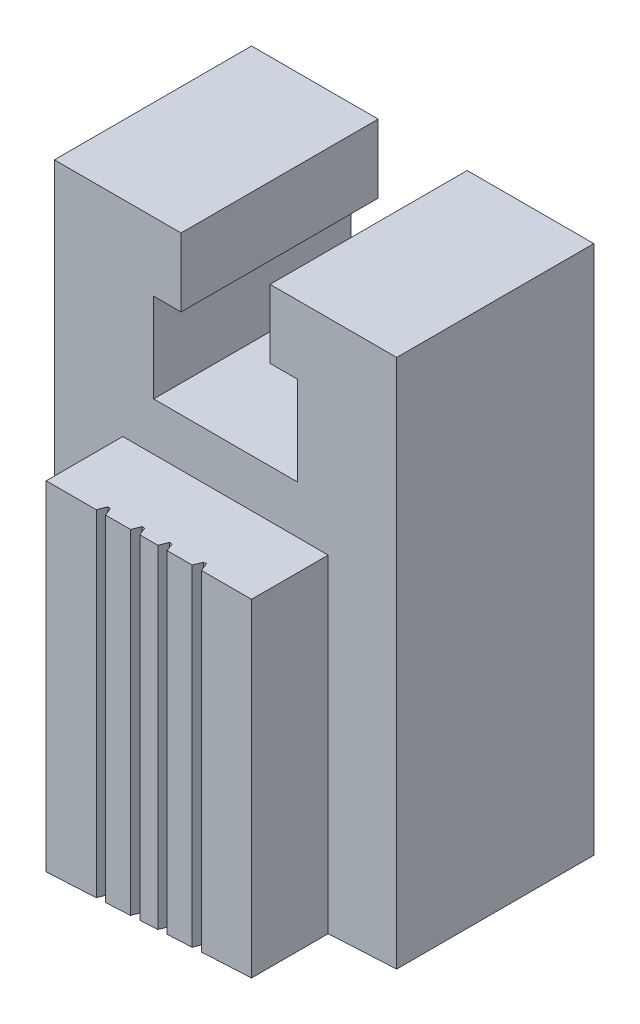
ISO-10303-21;
HEADER;
FILE_DESCRIPTION(('STEP AP214'),'2;1');
FILE_NAME('part.step','',(''),(''),'','','');
FILE_SCHEMA(('AUTOMOTIVE_DESIGN { 1 0 10303 214 1 1 1 1 }'));
ENDSEC;
DATA;
#1=APPLICATION_CONTEXT('core data for automotive mechanical design processes');
#2=APPLICATION_PROTOCOL_DEFINITION('international standard','automotive_design',2000,#1);
#3=PRODUCT_CONTEXT('',#1,'mechanical');
#4=PRODUCT('Part','Part','',(#3));
#5=PRODUCT_RELATED_PRODUCT_CATEGORY('part','',(#4));
#6=PRODUCT_DEFINITION_FORMATION('','',#4);
#7=PRODUCT_DEFINITION_CONTEXT('part definition',#1,'design');
#8=PRODUCT_DEFINITION('design','',#6,#7);
#9=PRODUCT_DEFINITION_SHAPE('','',#8);
#10=(LENGTH_UNIT() NAMED_UNIT(*) SI_UNIT(.MILLI.,.METRE.));
#11=(NAMED_UNIT(*) PLANE_ANGLE_UNIT() SI_UNIT($,.RADIAN.));
#12=(NAMED_UNIT(*) SI_UNIT($,.STERADIAN.) SOLID_ANGLE_UNIT());
#13=UNCERTAINTY_MEASURE_WITH_UNIT(LENGTH_MEASURE(1.E-05),#10,'distance_accuracy_value','');
#14=(GEOMETRIC_REPRESENTATION_CONTEXT(3) GLOBAL_UNCERTAINTY_ASSIGNED_CONTEXT((#13)) GLOBAL_UNIT_ASSIGNED_CONTEXT((#10,
#11,#12)) REPRESENTATION_CONTEXT('',''));
#15=CARTESIAN_POINT('',(0.,0.,0.));
#16=DIRECTION('',(0.,0.,1.));
#17=DIRECTION('',(1.,0.,0.));
#18=AXIS2_PLACEMENT_3D('',#15,#16,#17);
#19=CARTESIAN_POINT('',(0.,1.13686837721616E-13,20.));
#20=DIRECTION('',(1.,0.,0.));
#21=DIRECTION('',(0.,0.,-1.));
#22=AXIS2_PLACEMENT_3D('',#19,#20,#21);
#23=PLANE('',#22);
#24=DIRECTION('',(0.,0.,-1.));
#25=VECTOR('',#24,1.);
#26=CARTESIAN_POINT('',(0.,1.13686837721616E-13,20.));
#27=LINE('',#26,#25);
#28=CARTESIAN_POINT('',(0.,1.11022302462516E-13,14.4000000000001));
#29=VERTEX_POINT('',#28);
#30=CARTESIAN_POINT('',(0.,1.13686837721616E-13,0.));
#31=VERTEX_POINT('',#30);
#32=EDGE_CURVE('E260',#29,#31,#27,.T.);
#33=ORIENTED_EDGE('',*,*,#32,.F.);
#34=DIRECTION('',(0.,-1.,0.));
#35=VECTOR('',#34,1.);
#36=CARTESIAN_POINT('',(0.,25.,14.3999999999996));
#37=LINE('',#36,#35);
#38=CARTESIAN_POINT('',(0.,40.,14.3999999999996));
#39=VERTEX_POINT('',#38);
#40=EDGE_CURVE('E241',#39,#29,#37,.T.);
#41=ORIENTED_EDGE('',*,*,#40,.F.);
#42=DIRECTION('',(0.,0.,-1.));
#43=VECTOR('',#42,1.);
#44=CARTESIAN_POINT('',(0.,40.0000000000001,20.));
#45=LINE('',#44,#43);
#46=CARTESIAN_POINT('',(0.,40.0000000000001,0.));
#47=VERTEX_POINT('',#46);
#48=EDGE_CURVE('E460',#39,#47,#45,.T.);
#49=ORIENTED_EDGE('',*,*,#48,.T.);
#50=DIRECTION('',(0.,-1.,0.));
#51=VECTOR('',#50,1.);
#52=CARTESIAN_POINT('',(0.,1.13686837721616E-13,0.));
#53=LINE('',#52,#51);
#54=EDGE_CURVE('E268',#47,#31,#53,.T.);
#55=ORIENTED_EDGE('',*,*,#54,.T.);
#56=EDGE_LOOP('',(#33,#41,#49,#55));
#57=FACE_BOUND('',#56,.T.);
#58=ADVANCED_FACE('F34',(#57),#23,.F.);
#59=CARTESIAN_POINT('',(25.,1.31019448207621,20.));
#60=DIRECTION('',(-1.,0.,0.));
#61=DIRECTION('',(0.,0.,1.));
#62=AXIS2_PLACEMENT_3D('',#59,#60,#61);
#63=PLANE('',#62);
#64=DIRECTION('',(0.,-1.,0.));
#65=VECTOR('',#64,1.);
#66=CARTESIAN_POINT('',(25.,25.,14.3999999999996));
#67=LINE('',#66,#65);
#68=CARTESIAN_POINT('',(25.,40.,14.3999999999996));
#69=VERTEX_POINT('',#68);
#70=CARTESIAN_POINT('',(25.,1.31019448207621,14.4000000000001));
#71=VERTEX_POINT('',#70);
#72=EDGE_CURVE('E253',#69,#71,#67,.T.);
#73=ORIENTED_EDGE('',*,*,#72,.T.);
#74=DIRECTION('',(0.,0.,-1.));
#75=VECTOR('',#74,1.);
#76=CARTESIAN_POINT('',(25.,1.31019448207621,20.));
#77=LINE('',#76,#75);
#78=CARTESIAN_POINT('',(25.,1.31019448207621,0.));
#79=VERTEX_POINT('',#78);
#80=EDGE_CURVE('E270',#71,#79,#77,.T.);
#81=ORIENTED_EDGE('',*,*,#80,.T.);
#82=DIRECTION('',(0.,1.,0.));
#83=VECTOR('',#82,1.);
#84=CARTESIAN_POINT('',(25.,1.31019448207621,0.));
#85=LINE('',#84,#83);
#86=CARTESIAN_POINT('',(25.,40.0000000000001,0.));
#87=VERTEX_POINT('',#86);
#88=EDGE_CURVE('E424',#79,#87,#85,.T.);
#89=ORIENTED_EDGE('',*,*,#88,.T.);
#90=DIRECTION('',(0.,0.,-1.));
#91=VECTOR('',#90,1.);
#92=CARTESIAN_POINT('',(25.,40.0000000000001,20.));
#93=LINE('',#92,#91);
#94=EDGE_CURVE('E275',#69,#87,#93,.T.);
#95=ORIENTED_EDGE('',*,*,#94,.F.);
#96=EDGE_LOOP('',(#73,#81,#89,#95));
#97=FACE_BOUND('',#96,.T.);
#98=ADVANCED_FACE('F416',(#97),#63,.F.);
#99=CARTESIAN_POINT('',(0.,40.0000000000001,20.));
#100=DIRECTION('',(0.,0.,-1.));
#101=DIRECTION('',(-1.,0.,0.));
#102=AXIS2_PLACEMENT_3D('',#99,#100,#101);
#103=PLANE('',#102);
#104=DIRECTION('',(0.,1.,0.));
#105=VECTOR('',#104,1.);
#106=CARTESIAN_POINT('',(20.,1.11022302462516E-13,19.9999999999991));
#107=LINE('',#106,#105);
#108=CARTESIAN_POINT('',(20.,1.04815558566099,19.9999999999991));
#109=VERTEX_POINT('',#108);
#110=CARTESIAN_POINT('',(20.,25.,19.9999999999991));
#111=VERTEX_POINT('',#110);
#112=EDGE_CURVE('E326',#109,#111,#107,.T.);
#113=ORIENTED_EDGE('',*,*,#112,.T.);
#114=DIRECTION('',(1.,0.,0.));
#115=VECTOR('',#114,1.);
#116=CARTESIAN_POINT('',(0.,25.,20.));
#117=LINE('',#116,#115);
#118=CARTESIAN_POINT('',(16.3400000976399,25.,19.9999999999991));
#119=VERTEX_POINT('',#118);
#120=EDGE_CURVE('E315',#119,#111,#117,.T.);
#121=ORIENTED_EDGE('',*,*,#120,.F.);
#122=DIRECTION('',(0.,1.,0.));
#123=VECTOR('',#122,1.);
#124=CARTESIAN_POINT('',(16.3400000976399,1.11022302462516E-13,19.9999999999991));
#125=LINE('',#124,#123);
#126=CARTESIAN_POINT('',(16.3400000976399,0.85634311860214,19.9999999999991));
#127=VERTEX_POINT('',#126);
#128=EDGE_CURVE('E324',#127,#119,#125,.T.);
#129=ORIENTED_EDGE('',*,*,#128,.F.);
#130=DIRECTION('',(0.998629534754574,0.0523359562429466,0.));
#131=VECTOR('',#130,1.);
#132=CARTESIAN_POINT('',(0.,1.13686837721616E-13,20.));
#133=LINE('',#132,#131);
#134=EDGE_CURVE('E459',#127,#109,#133,.T.);
#135=ORIENTED_EDGE('',*,*,#134,.T.);
#136=EDGE_LOOP('',(#113,#121,#129,#135));
#137=FACE_BOUND('',#136,.T.);
#138=ADVANCED_FACE('F322',(#137),#103,.F.);
#139=DIRECTION('',(0.,1.,0.));
#140=VECTOR('',#139,1.);
#141=CARTESIAN_POINT('',(15.6599999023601,1.11022302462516E-13,19.9999999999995));
#142=LINE('',#141,#140);
#143=CARTESIAN_POINT('',(15.6599999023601,0.820705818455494,19.9999999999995));
#144=VERTEX_POINT('',#143);
#145=CARTESIAN_POINT('',(15.6599999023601,25.,19.9999999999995));
#146=VERTEX_POINT('',#145);
#147=EDGE_CURVE('E535',#144,#146,#142,.T.);
#148=ORIENTED_EDGE('',*,*,#147,.T.);
#149=CARTESIAN_POINT('',(13.8400000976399,25.,19.9999999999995));
#150=VERTEX_POINT('',#149);
#151=EDGE_CURVE('E327',#150,#146,#117,.T.);
#152=ORIENTED_EDGE('',*,*,#151,.F.);
#153=DIRECTION('',(0.,1.,0.));
#154=VECTOR('',#153,1.);
#155=CARTESIAN_POINT('',(13.8400000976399,1.11022302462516E-13,19.9999999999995));
#156=LINE('',#155,#154);
#157=CARTESIAN_POINT('',(13.8400000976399,0.72532367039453,19.9999999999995));
#158=VERTEX_POINT('',#157);
#159=EDGE_CURVE('E533',#158,#150,#156,.T.);
#160=ORIENTED_EDGE('',*,*,#159,.F.);
#161=EDGE_CURVE('E495',#158,#144,#133,.T.);
#162=ORIENTED_EDGE('',*,*,#161,.T.);
#163=EDGE_LOOP('',(#148,#152,#160,#162));
#164=FACE_BOUND('',#163,.T.);
#165=ADVANCED_FACE('F532',(#164),#103,.F.);
#166=DIRECTION('',(0.,1.,0.));
#167=VECTOR('',#166,1.);
#168=CARTESIAN_POINT('',(13.1599999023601,1.11022302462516E-13,19.9999999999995));
#169=LINE('',#168,#167);
#170=CARTESIAN_POINT('',(13.1599999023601,0.689686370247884,19.9999999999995));
#171=VERTEX_POINT('',#170);
#172=CARTESIAN_POINT('',(13.1599999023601,25.,19.9999999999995));
#173=VERTEX_POINT('',#172);
#174=EDGE_CURVE('E353',#171,#173,#169,.T.);
#175=ORIENTED_EDGE('',*,*,#174,.T.);
#176=CARTESIAN_POINT('',(11.8400000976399,25.,19.9999999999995));
#177=VERTEX_POINT('',#176);
#178=EDGE_CURVE('E332',#177,#173,#117,.T.);
#179=ORIENTED_EDGE('',*,*,#178,.F.);
#180=DIRECTION('',(0.,1.,0.));
#181=VECTOR('',#180,1.);
#182=CARTESIAN_POINT('',(11.8400000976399,1.11022302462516E-13,19.9999999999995));
#183=LINE('',#182,#181);
#184=CARTESIAN_POINT('',(11.8400000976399,0.620508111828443,19.9999999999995));
#185=VERTEX_POINT('',#184);
#186=EDGE_CURVE('E351',#185,#177,#183,.T.);
#187=ORIENTED_EDGE('',*,*,#186,.F.);
#188=EDGE_CURVE('E354',#185,#171,#133,.T.);
#189=ORIENTED_EDGE('',*,*,#188,.T.);
#190=EDGE_LOOP('',(#175,#179,#187,#189));
#191=FACE_BOUND('',#190,.T.);
#192=ADVANCED_FACE('F349',(#191),#103,.F.);
#193=DIRECTION('',(0.,1.,0.));
#194=VECTOR('',#193,1.);
#195=CARTESIAN_POINT('',(11.1599999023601,1.11022302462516E-13,20.));
#196=LINE('',#195,#194);
#197=CARTESIAN_POINT('',(11.1599999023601,0.584870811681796,20.));
#198=VERTEX_POINT('',#197);
#199=CARTESIAN_POINT('',(11.1599999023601,25.,20.));
#200=VERTEX_POINT('',#199);
#201=EDGE_CURVE('E367',#198,#200,#196,.T.);
#202=ORIENTED_EDGE('',*,*,#201,.T.);
#203=CARTESIAN_POINT('',(9.34000009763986,25.,20.));
#204=VERTEX_POINT('',#203);
#205=EDGE_CURVE('E338',#204,#200,#117,.T.);
#206=ORIENTED_EDGE('',*,*,#205,.F.);
#207=DIRECTION('',(0.,1.,0.));
#208=VECTOR('',#207,1.);
#209=CARTESIAN_POINT('',(9.34000009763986,1.11022302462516E-13,20.));
#210=LINE('',#209,#208);
#211=CARTESIAN_POINT('',(9.34000009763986,0.489488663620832,20.));
#212=VERTEX_POINT('',#211);
#213=EDGE_CURVE('E370',#212,#204,#210,.T.);
#214=ORIENTED_EDGE('',*,*,#213,.F.);
#215=EDGE_CURVE('E498',#212,#198,#133,.T.);
#216=ORIENTED_EDGE('',*,*,#215,.T.);
#217=EDGE_LOOP('',(#202,#206,#214,#216));
#218=FACE_BOUND('',#217,.T.);
#219=ADVANCED_FACE('F505',(#218),#103,.F.);
#220=DIRECTION('',(0.,1.,0.));
#221=VECTOR('',#220,1.);
#222=CARTESIAN_POINT('',(8.65999990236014,1.11022302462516E-13,20.));
#223=LINE('',#222,#221);
#224=CARTESIAN_POINT('',(8.65999990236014,0.453851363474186,20.));
#225=VERTEX_POINT('',#224);
#226=CARTESIAN_POINT('',(8.65999990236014,25.,20.));
#227=VERTEX_POINT('',#226);
#228=EDGE_CURVE('E377',#225,#227,#223,.T.);
#229=ORIENTED_EDGE('',*,*,#228,.T.);
#230=CARTESIAN_POINT('',(5.,25.,20.));
#231=VERTEX_POINT('',#230);
#232=EDGE_CURVE('E330',#231,#227,#117,.T.);
#233=ORIENTED_EDGE('',*,*,#232,.F.);
#234=DIRECTION('',(0.,1.,0.));
#235=VECTOR('',#234,1.);
#236=CARTESIAN_POINT('',(5.,1.11022302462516E-13,20.));
#237=LINE('',#236,#235);
#238=CARTESIAN_POINT('',(5.,0.262038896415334,20.));
#239=VERTEX_POINT('',#238);
#240=EDGE_CURVE('E380',#239,#231,#237,.T.);
#241=ORIENTED_EDGE('',*,*,#240,.F.);
#242=EDGE_CURVE('E463',#239,#225,#133,.T.);
#243=ORIENTED_EDGE('',*,*,#242,.T.);
#244=EDGE_LOOP('',(#229,#233,#241,#243));
#245=FACE_BOUND('',#244,.T.);
#246=ADVANCED_FACE('F550',(#245),#103,.F.);
#247=CARTESIAN_POINT('',(0.,1.13686837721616E-13,20.));
#248=DIRECTION('',(-0.0523359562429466,0.998629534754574,0.));
#249=DIRECTION('',(-0.998629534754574,-0.0523359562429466,0.));
#250=AXIS2_PLACEMENT_3D('',#247,#248,#249);
#251=PLANE('',#250);
#252=DIRECTION('',(0.998629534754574,0.0523359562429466,0.));
#253=VECTOR('',#252,1.);
#254=CARTESIAN_POINT('',(0.,1.13686837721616E-13,14.4000000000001));
#255=LINE('',#254,#253);
#256=CARTESIAN_POINT('',(20.,1.04815558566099,14.4000000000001));
#257=VERTEX_POINT('',#256);
#258=EDGE_CURVE('E264',#257,#71,#255,.T.);
#259=ORIENTED_EDGE('',*,*,#258,.F.);
#260=DIRECTION('',(0.,0.,-1.));
#261=VECTOR('',#260,1.);
#262=CARTESIAN_POINT('',(20.,1.04815558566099,20.));
#263=LINE('',#262,#261);
#264=EDGE_CURVE('E410',#109,#257,#263,.T.);
#265=ORIENTED_EDGE('',*,*,#264,.F.);
#266=ORIENTED_EDGE('',*,*,#134,.F.);
#267=DIRECTION('',(0.371320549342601,0.0194600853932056,0.928300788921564));
#268=VECTOR('',#267,1.);
#269=CARTESIAN_POINT('',(14.0808701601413,0.737947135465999,14.3521787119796));
#270=LINE('',#269,#268);
#271=CARTESIAN_POINT('',(16.0999999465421,0.843765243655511,19.3999999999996));
#272=VERTEX_POINT('',#271);
#273=EDGE_CURVE('E408',#272,#127,#270,.T.);
#274=ORIENTED_EDGE('',*,*,#273,.F.);
#275=DIRECTION('',(0.998629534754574,0.0523359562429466,0.));
#276=VECTOR('',#275,1.);
#277=CARTESIAN_POINT('',(0.,1.13686837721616E-13,19.3999999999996));
#278=LINE('',#277,#276);
#279=CARTESIAN_POINT('',(15.9000000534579,0.833283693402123,19.3999999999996));
#280=VERTEX_POINT('',#279);
#281=EDGE_CURVE('E406',#280,#272,#278,.T.);
#282=ORIENTED_EDGE('',*,*,#281,.F.);
#283=DIRECTION('',(0.371320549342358,0.0194600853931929,-0.928300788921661));
#284=VECTOR('',#283,1.);
#285=CARTESIAN_POINT('',(13.4948851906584,0.707236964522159,25.412783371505));
#286=LINE('',#285,#284);
#287=EDGE_CURVE('E404',#144,#280,#286,.T.);
#288=ORIENTED_EDGE('',*,*,#287,.F.);
#289=ORIENTED_EDGE('',*,*,#161,.F.);
#290=DIRECTION('',(0.37132054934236,0.0194600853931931,0.92830078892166));
#291=VECTOR('',#290,1.);
#292=CARTESIAN_POINT('',(11.9265142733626,0.625042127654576,15.2162884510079));
#293=LINE('',#292,#291);
#294=CARTESIAN_POINT('',(13.5999999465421,0.712745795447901,19.3999999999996));
#295=VERTEX_POINT('',#294);
#296=EDGE_CURVE('E402',#295,#158,#293,.T.);
#297=ORIENTED_EDGE('',*,*,#296,.F.);
#298=DIRECTION('',(0.998629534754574,0.0523359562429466,0.));
#299=VECTOR('',#298,1.);
#300=CARTESIAN_POINT('',(0.,1.13686837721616E-13,19.3999999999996));
#301=LINE('',#300,#299);
#302=CARTESIAN_POINT('',(13.4000000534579,0.702264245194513,19.3999999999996));
#303=VERTEX_POINT('',#302);
#304=EDGE_CURVE('E400',#303,#295,#301,.T.);
#305=ORIENTED_EDGE('',*,*,#304,.F.);
#306=DIRECTION('',(0.371320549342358,0.0194600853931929,-0.928300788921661));
#307=VECTOR('',#306,1.);
#308=CARTESIAN_POINT('',(11.340529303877,0.594331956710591,24.5486736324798));
#309=LINE('',#308,#307);
#310=EDGE_CURVE('E398',#171,#303,#309,.T.);
#311=ORIENTED_EDGE('',*,*,#310,.F.);
#312=ORIENTED_EDGE('',*,*,#188,.F.);
#313=DIRECTION('',(0.371320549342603,0.0194600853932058,0.928300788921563));
#314=VECTOR('',#313,1.);
#315=CARTESIAN_POINT('',(10.2030295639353,0.534718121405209,15.9075762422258));
#316=LINE('',#315,#314);
#317=CARTESIAN_POINT('',(11.5999999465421,0.607930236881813,19.4000000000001));
#318=VERTEX_POINT('',#317);
#319=EDGE_CURVE('E396',#318,#185,#316,.T.);
#320=ORIENTED_EDGE('',*,*,#319,.F.);
#321=DIRECTION('',(0.998629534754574,0.0523359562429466,0.));
#322=VECTOR('',#321,1.);
#323=CARTESIAN_POINT('',(0.,1.13686837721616E-13,19.4000000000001));
#324=LINE('',#323,#322);
#325=CARTESIAN_POINT('',(11.4000000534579,0.597448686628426,19.4000000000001));
#326=VERTEX_POINT('',#325);
#327=EDGE_CURVE('E394',#326,#318,#324,.T.);
#328=ORIENTED_EDGE('',*,*,#327,.F.);
#329=DIRECTION('',(0.371320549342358,0.0194600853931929,-0.928300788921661));
#330=VECTOR('',#329,1.);
#331=CARTESIAN_POINT('',(9.61704459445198,0.504007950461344,23.8573858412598));
#332=LINE('',#331,#330);
#333=EDGE_CURVE('E392',#198,#326,#332,.T.);
#334=ORIENTED_EDGE('',*,*,#333,.F.);
#335=ORIENTED_EDGE('',*,*,#215,.F.);
#336=DIRECTION('',(0.371320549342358,0.0194600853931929,0.928300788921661));
#337=VECTOR('',#336,1.);
#338=CARTESIAN_POINT('',(8.04867367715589,0.421813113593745,16.7716859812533));
#339=LINE('',#338,#337);
#340=CARTESIAN_POINT('',(9.09999994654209,0.476910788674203,19.4000000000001));
#341=VERTEX_POINT('',#340);
#342=EDGE_CURVE('E390',#341,#212,#339,.T.);
#343=ORIENTED_EDGE('',*,*,#342,.F.);
#344=DIRECTION('',(0.998629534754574,0.0523359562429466,0.));
#345=VECTOR('',#344,1.);
#346=CARTESIAN_POINT('',(0.,1.13686837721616E-13,19.4000000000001));
#347=LINE('',#346,#345);
#348=CARTESIAN_POINT('',(8.90000005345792,0.466429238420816,19.4000000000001));
#349=VERTEX_POINT('',#348);
#350=EDGE_CURVE('E388',#349,#341,#347,.T.);
#351=ORIENTED_EDGE('',*,*,#350,.F.);
#352=DIRECTION('',(0.371320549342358,0.0194600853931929,-0.928300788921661));
#353=VECTOR('',#352,1.);
#354=CARTESIAN_POINT('',(7.46268870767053,0.391102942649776,22.9932761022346));
#355=LINE('',#354,#353);
#356=EDGE_CURVE('E385',#225,#349,#355,.T.);
#357=ORIENTED_EDGE('',*,*,#356,.F.);
#358=ORIENTED_EDGE('',*,*,#242,.F.);
#359=DIRECTION('',(0.,0.,1.));
#360=VECTOR('',#359,1.);
#361=CARTESIAN_POINT('',(5.,0.262038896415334,20.));
#362=LINE('',#361,#360);
#363=CARTESIAN_POINT('',(5.,0.262038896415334,14.4000000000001));
#364=VERTEX_POINT('',#363);
#365=EDGE_CURVE('E263',#364,#239,#362,.T.);
#366=ORIENTED_EDGE('',*,*,#365,.F.);
#367=DIRECTION('',(0.998629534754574,0.0523359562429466,0.));
#368=VECTOR('',#367,1.);
#369=CARTESIAN_POINT('',(0.,1.13686837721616E-13,14.4000000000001));
#370=LINE('',#369,#368);
#371=EDGE_CURVE('E245',#29,#364,#370,.T.);
#372=ORIENTED_EDGE('',*,*,#371,.F.);
#373=ORIENTED_EDGE('',*,*,#32,.T.);
#374=DIRECTION('',(0.998629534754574,0.0523359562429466,0.));
#375=VECTOR('',#374,1.);
#376=CARTESIAN_POINT('',(0.,1.13686837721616E-13,0.));
#377=LINE('',#376,#375);
#378=EDGE_CURVE('E421',#31,#79,#377,.T.);
#379=ORIENTED_EDGE('',*,*,#378,.T.);
#380=ORIENTED_EDGE('',*,*,#80,.F.);
#381=EDGE_LOOP('',(#259,#265,#266,#274,#282,#288,#289,#297,#305,#311,#312,#320,#328,#334,#335,
#343,#351,#357,#358,#366,#372,#373,#379,#380));
#382=FACE_BOUND('',#381,.T.);
#383=ADVANCED_FACE('F258',(#382),#251,.F.);
#384=CARTESIAN_POINT('',(0.,25.,20.));
#385=DIRECTION('',(0.,1.,0.));
#386=DIRECTION('',(0.,0.,1.));
#387=AXIS2_PLACEMENT_3D('',#384,#385,#386);
#388=PLANE('',#387);
#389=ORIENTED_EDGE('',*,*,#120,.T.);
#390=DIRECTION('',(0.,0.,-1.));
#391=VECTOR('',#390,1.);
#392=CARTESIAN_POINT('',(20.,25.,20.));
#393=LINE('',#392,#391);
#394=CARTESIAN_POINT('',(20.,25.,14.3999999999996));
#395=VERTEX_POINT('',#394);
#396=EDGE_CURVE('E12',#111,#395,#393,.T.);
#397=ORIENTED_EDGE('',*,*,#396,.T.);
#398=DIRECTION('',(1.,0.,0.));
#399=VECTOR('',#398,1.);
#400=CARTESIAN_POINT('',(0.,25.,14.3999999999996));
#401=LINE('',#400,#399);
#402=CARTESIAN_POINT('',(5.,25.,14.4000000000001));
#403=VERTEX_POINT('',#402);
#404=EDGE_CURVE('E328',#403,#395,#401,.T.);
#405=ORIENTED_EDGE('',*,*,#404,.F.);
#406=DIRECTION('',(0.,0.,1.));
#407=VECTOR('',#406,1.);
#408=CARTESIAN_POINT('',(5.,25.,20.));
#409=LINE('',#408,#407);
#410=EDGE_CURVE('E269',#403,#231,#409,.T.);
#411=ORIENTED_EDGE('',*,*,#410,.T.);
#412=ORIENTED_EDGE('',*,*,#232,.T.);
#413=DIRECTION('',(0.371390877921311,0.,-0.928476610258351));
#414=VECTOR('',#413,1.);
#415=CARTESIAN_POINT('',(7.46551586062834,25.,22.9862082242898));
#416=LINE('',#415,#414);
#417=CARTESIAN_POINT('',(8.90000005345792,25.,19.4000000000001));
#418=VERTEX_POINT('',#417);
#419=EDGE_CURVE('E273',#227,#418,#416,.T.);
#420=ORIENTED_EDGE('',*,*,#419,.T.);
#421=DIRECTION('',(1.,0.,0.));
#422=VECTOR('',#421,1.);
#423=CARTESIAN_POINT('',(0.,25.,19.4000000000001));
#424=LINE('',#423,#422);
#425=CARTESIAN_POINT('',(9.09999994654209,25.,19.4000000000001));
#426=VERTEX_POINT('',#425);
#427=EDGE_CURVE('E281',#418,#426,#424,.T.);
#428=ORIENTED_EDGE('',*,*,#427,.T.);
#429=DIRECTION('',(0.371390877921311,0.,0.928476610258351));
#430=VECTOR('',#429,1.);
#431=CARTESIAN_POINT('',(8.05172282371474,25.,16.7793088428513));
#432=LINE('',#431,#430);
#433=EDGE_CURVE('E284',#426,#204,#432,.T.);
#434=ORIENTED_EDGE('',*,*,#433,.T.);
#435=ORIENTED_EDGE('',*,*,#205,.T.);
#436=DIRECTION('',(0.371390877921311,0.,-0.928476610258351));
#437=VECTOR('',#436,1.);
#438=CARTESIAN_POINT('',(9.62068790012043,25.,23.848277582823));
#439=LINE('',#438,#437);
#440=CARTESIAN_POINT('',(11.4000000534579,25.,19.4000000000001));
#441=VERTEX_POINT('',#440);
#442=EDGE_CURVE('E287',#200,#441,#439,.T.);
#443=ORIENTED_EDGE('',*,*,#442,.T.);
#444=DIRECTION('',(1.,0.,0.));
#445=VECTOR('',#444,1.);
#446=CARTESIAN_POINT('',(0.,25.,19.4000000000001));
#447=LINE('',#446,#445);
#448=CARTESIAN_POINT('',(11.5999999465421,25.,19.4000000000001));
#449=VERTEX_POINT('',#448);
#450=EDGE_CURVE('E290',#441,#449,#447,.T.);
#451=ORIENTED_EDGE('',*,*,#450,.T.);
#452=DIRECTION('',(0.371390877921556,0.,0.928476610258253));
#453=VECTOR('',#452,1.);
#454=CARTESIAN_POINT('',(10.2068948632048,25.,15.9172394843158));
#455=LINE('',#454,#453);
#456=EDGE_CURVE('E293',#449,#177,#455,.T.);
#457=ORIENTED_EDGE('',*,*,#456,.T.);
#458=ORIENTED_EDGE('',*,*,#178,.T.);
#459=DIRECTION('',(0.371390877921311,0.,-0.928476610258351));
#460=VECTOR('',#459,1.);
#461=CARTESIAN_POINT('',(11.344825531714,25.,24.5379330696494));
#462=LINE('',#461,#460);
#463=CARTESIAN_POINT('',(13.4000000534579,25.,19.3999999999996));
#464=VERTEX_POINT('',#463);
#465=EDGE_CURVE('E296',#173,#464,#462,.T.);
#466=ORIENTED_EDGE('',*,*,#465,.T.);
#467=DIRECTION('',(1.,0.,0.));
#468=VECTOR('',#467,1.);
#469=CARTESIAN_POINT('',(0.,25.,19.3999999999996));
#470=LINE('',#469,#468);
#471=CARTESIAN_POINT('',(13.5999999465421,25.,19.3999999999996));
#472=VERTEX_POINT('',#471);
#473=EDGE_CURVE('E299',#464,#472,#470,.T.);
#474=ORIENTED_EDGE('',*,*,#473,.T.);
#475=DIRECTION('',(0.371390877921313,0.,0.92847661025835));
#476=VECTOR('',#475,1.);
#477=CARTESIAN_POINT('',(11.9310324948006,25.,15.2275839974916));
#478=LINE('',#477,#476);
#479=EDGE_CURVE('E302',#472,#150,#478,.T.);
#480=ORIENTED_EDGE('',*,*,#479,.T.);
#481=ORIENTED_EDGE('',*,*,#151,.T.);
#482=DIRECTION('',(0.371390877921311,0.,-0.928476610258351));
#483=VECTOR('',#482,1.);
#484=CARTESIAN_POINT('',(13.499997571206,25.,25.4000024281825));
#485=LINE('',#484,#483);
#486=CARTESIAN_POINT('',(15.9000000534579,25.,19.3999999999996));
#487=VERTEX_POINT('',#486);
#488=EDGE_CURVE('E305',#146,#487,#485,.T.);
#489=ORIENTED_EDGE('',*,*,#488,.T.);
#490=DIRECTION('',(1.,0.,0.));
#491=VECTOR('',#490,1.);
#492=CARTESIAN_POINT('',(0.,25.,19.3999999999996));
#493=LINE('',#492,#491);
#494=CARTESIAN_POINT('',(16.0999999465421,25.,19.3999999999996));
#495=VERTEX_POINT('',#494);
#496=EDGE_CURVE('E308',#487,#495,#493,.T.);
#497=ORIENTED_EDGE('',*,*,#496,.T.);
#498=DIRECTION('',(0.371390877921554,0.,0.928476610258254));
#499=VECTOR('',#498,1.);
#500=CARTESIAN_POINT('',(14.08620453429,25.,14.3655146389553));
#501=LINE('',#500,#499);
#502=EDGE_CURVE('E41',#495,#119,#501,.T.);
#503=ORIENTED_EDGE('',*,*,#502,.T.);
#504=EDGE_LOOP('',(#389,#397,#405,#411,#412,#420,#428,#434,#435,#443,#451,#457,#458,#466,#474,
#480,#481,#489,#497,#503));
#505=FACE_BOUND('',#504,.T.);
#506=ADVANCED_FACE('F314',(#505),#388,.T.);
#507=CARTESIAN_POINT('',(15.7499999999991,40.0000000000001,20.));
#508=DIRECTION('',(0.,-1.,0.));
#509=DIRECTION('',(0.,0.,-1.));
#510=AXIS2_PLACEMENT_3D('',#507,#508,#509);
#511=PLANE('',#510);
#512=DIRECTION('',(1.,0.,0.));
#513=VECTOR('',#512,1.);
#514=CARTESIAN_POINT('',(0.,40.,14.3999999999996));
#515=LINE('',#514,#513);
#516=CARTESIAN_POINT('',(15.7499999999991,40.,14.3999999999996));
#517=VERTEX_POINT('',#516);
#518=EDGE_CURVE('E252',#517,#69,#515,.T.);
#519=ORIENTED_EDGE('',*,*,#518,.T.);
#520=ORIENTED_EDGE('',*,*,#94,.T.);
#521=DIRECTION('',(-1.,0.,0.));
#522=VECTOR('',#521,1.);
#523=CARTESIAN_POINT('',(15.7499999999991,40.0000000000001,0.));
#524=LINE('',#523,#522);
#525=CARTESIAN_POINT('',(15.7499999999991,40.0000000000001,0.));
#526=VERTEX_POINT('',#525);
#527=EDGE_CURVE('E430',#87,#526,#524,.T.);
#528=ORIENTED_EDGE('',*,*,#527,.T.);
#529=DIRECTION('',(0.,0.,-1.));
#530=VECTOR('',#529,1.);
#531=CARTESIAN_POINT('',(15.7499999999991,40.0000000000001,20.));
#532=LINE('',#531,#530);
#533=EDGE_CURVE('E477',#517,#526,#532,.T.);
#534=ORIENTED_EDGE('',*,*,#533,.F.);
#535=EDGE_LOOP('',(#519,#520,#528,#534));
#536=FACE_BOUND('',#535,.T.);
#537=ADVANCED_FACE('F479',(#536),#511,.F.);
#538=CARTESIAN_POINT('',(15.7499999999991,40.0000000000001,20.));
#539=DIRECTION('',(1.,1.8179902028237E-13,0.));
#540=DIRECTION('',(-1.8179902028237E-13,1.,0.));
#541=AXIS2_PLACEMENT_3D('',#538,#539,#540);
#542=PLANE('',#541);
#543=DIRECTION('',(1.8179902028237E-13,-1.,0.));
#544=VECTOR('',#543,1.);
#545=CARTESIAN_POINT('',(15.7499999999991,40.0000000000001,14.3999999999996));
#546=LINE('',#545,#544);
#547=CARTESIAN_POINT('',(15.75,35.0000000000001,14.3999999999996));
#548=VERTEX_POINT('',#547);
#549=EDGE_CURVE('E493',#517,#548,#546,.T.);
#550=ORIENTED_EDGE('',*,*,#549,.F.);
#551=ORIENTED_EDGE('',*,*,#533,.T.);
#552=DIRECTION('',(1.81799020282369E-13,-1.,0.));
#553=VECTOR('',#552,1.);
#554=CARTESIAN_POINT('',(15.7499999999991,40.0000000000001,0.));
#555=LINE('',#554,#553);
#556=CARTESIAN_POINT('',(15.75,35.0000000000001,0.));
#557=VERTEX_POINT('',#556);
#558=EDGE_CURVE('E432',#526,#557,#555,.T.);
#559=ORIENTED_EDGE('',*,*,#558,.T.);
#560=DIRECTION('',(0.,0.,-1.));
#561=VECTOR('',#560,1.);
#562=CARTESIAN_POINT('',(15.75,35.0000000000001,20.));
#563=LINE('',#562,#561);
#564=EDGE_CURVE('E475',#548,#557,#563,.T.);
#565=ORIENTED_EDGE('',*,*,#564,.F.);
#566=EDGE_LOOP('',(#550,#551,#559,#565));
#567=FACE_BOUND('',#566,.T.);
#568=ADVANCED_FACE('F619',(#567),#542,.F.);
#569=CARTESIAN_POINT('',(15.75,35.0000000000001,20.));
#570=DIRECTION('',(0.,1.,0.));
#571=DIRECTION('',(0.,0.,1.));
#572=AXIS2_PLACEMENT_3D('',#569,#570,#571);
#573=PLANE('',#572);
#574=DIRECTION('',(1.,0.,0.));
#575=VECTOR('',#574,1.);
#576=CARTESIAN_POINT('',(15.75,35.0000000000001,14.3999999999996));
#577=LINE('',#576,#575);
#578=CARTESIAN_POINT('',(17.75,35.0000000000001,14.3999999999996));
#579=VERTEX_POINT('',#578);
#580=EDGE_CURVE('E491',#548,#579,#577,.T.);
#581=ORIENTED_EDGE('',*,*,#580,.F.);
#582=ORIENTED_EDGE('',*,*,#564,.T.);
#583=DIRECTION('',(1.,0.,0.));
#584=VECTOR('',#583,1.);
#585=CARTESIAN_POINT('',(15.75,35.0000000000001,0.));
#586=LINE('',#585,#584);
#587=CARTESIAN_POINT('',(17.75,35.0000000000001,0.));
#588=VERTEX_POINT('',#587);
#589=EDGE_CURVE('E438',#557,#588,#586,.T.);
#590=ORIENTED_EDGE('',*,*,#589,.T.);
#591=DIRECTION('',(0.,0.,-1.));
#592=VECTOR('',#591,1.);
#593=CARTESIAN_POINT('',(17.75,35.0000000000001,20.));
#594=LINE('',#593,#592);
#595=EDGE_CURVE('E473',#579,#588,#594,.T.);
#596=ORIENTED_EDGE('',*,*,#595,.F.);
#597=EDGE_LOOP('',(#581,#582,#590,#596));
#598=FACE_BOUND('',#597,.T.);
#599=ADVANCED_FACE('F616',(#598),#573,.F.);
#600=CARTESIAN_POINT('',(17.75,35.0000000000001,20.));
#601=DIRECTION('',(1.,-1.40379161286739E-13,0.));
#602=DIRECTION('',(1.40379161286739E-13,1.,0.));
#603=AXIS2_PLACEMENT_3D('',#600,#601,#602);
#604=PLANE('',#603);
#605=DIRECTION('',(-1.40379161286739E-13,-1.,0.));
#606=VECTOR('',#605,1.);
#607=CARTESIAN_POINT('',(17.75,35.0000000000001,14.3999999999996));
#608=LINE('',#607,#606);
#609=CARTESIAN_POINT('',(17.7499999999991,28.5000000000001,14.3999999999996));
#610=VERTEX_POINT('',#609);
#611=EDGE_CURVE('E489',#579,#610,#608,.T.);
#612=ORIENTED_EDGE('',*,*,#611,.F.);
#613=ORIENTED_EDGE('',*,*,#595,.T.);
#614=DIRECTION('',(-1.40379161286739E-13,-1.,0.));
#615=VECTOR('',#614,1.);
#616=CARTESIAN_POINT('',(17.75,35.0000000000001,0.));
#617=LINE('',#616,#615);
#618=CARTESIAN_POINT('',(17.7499999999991,28.5000000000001,0.));
#619=VERTEX_POINT('',#618);
#620=EDGE_CURVE('E441',#588,#619,#617,.T.);
#621=ORIENTED_EDGE('',*,*,#620,.T.);
#622=DIRECTION('',(0.,0.,-1.));
#623=VECTOR('',#622,1.);
#624=CARTESIAN_POINT('',(17.7499999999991,28.5000000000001,20.));
#625=LINE('',#624,#623);
#626=EDGE_CURVE('E471',#610,#619,#625,.T.);
#627=ORIENTED_EDGE('',*,*,#626,.F.);
#628=EDGE_LOOP('',(#612,#613,#621,#627));
#629=FACE_BOUND('',#628,.T.);
#630=ADVANCED_FACE('F612',(#629),#604,.F.);
#631=CARTESIAN_POINT('',(7.25,28.5000000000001,20.));
#632=DIRECTION('',(0.,-1.,0.));
#633=DIRECTION('',(0.,0.,-1.));
#634=AXIS2_PLACEMENT_3D('',#631,#632,#633);
#635=PLANE('',#634);
#636=DIRECTION('',(-1.,0.,0.));
#637=VECTOR('',#636,1.);
#638=CARTESIAN_POINT('',(7.25,28.5000000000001,14.3999999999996));
#639=LINE('',#638,#637);
#640=CARTESIAN_POINT('',(7.25,28.5000000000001,14.3999999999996));
#641=VERTEX_POINT('',#640);
#642=EDGE_CURVE('E487',#610,#641,#639,.T.);
#643=ORIENTED_EDGE('',*,*,#642,.F.);
#644=ORIENTED_EDGE('',*,*,#626,.T.);
#645=DIRECTION('',(-1.,0.,0.));
#646=VECTOR('',#645,1.);
#647=CARTESIAN_POINT('',(7.25,28.5000000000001,0.));
#648=LINE('',#647,#646);
#649=CARTESIAN_POINT('',(7.25,28.5000000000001,0.));
#650=VERTEX_POINT('',#649);
#651=EDGE_CURVE('E444',#619,#650,#648,.T.);
#652=ORIENTED_EDGE('',*,*,#651,.T.);
#653=DIRECTION('',(0.,0.,-1.));
#654=VECTOR('',#653,1.);
#655=CARTESIAN_POINT('',(7.25,28.5000000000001,20.));
#656=LINE('',#655,#654);
#657=EDGE_CURVE('E469',#641,#650,#656,.T.);
#658=ORIENTED_EDGE('',*,*,#657,.F.);
#659=EDGE_LOOP('',(#643,#644,#652,#658));
#660=FACE_BOUND('',#659,.T.);
#661=ADVANCED_FACE('F608',(#660),#635,.F.);
#662=CARTESIAN_POINT('',(7.25,35.0000000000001,20.));
#663=DIRECTION('',(-1.,0.,0.));
#664=DIRECTION('',(0.,0.,1.));
#665=AXIS2_PLACEMENT_3D('',#662,#663,#664);
#666=PLANE('',#665);
#667=DIRECTION('',(0.,1.,0.));
#668=VECTOR('',#667,1.);
#669=CARTESIAN_POINT('',(7.25,35.0000000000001,14.3999999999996));
#670=LINE('',#669,#668);
#671=CARTESIAN_POINT('',(7.25,35.0000000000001,14.3999999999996));
#672=VERTEX_POINT('',#671);
#673=EDGE_CURVE('E485',#641,#672,#670,.T.);
#674=ORIENTED_EDGE('',*,*,#673,.F.);
#675=ORIENTED_EDGE('',*,*,#657,.T.);
#676=DIRECTION('',(0.,1.,0.));
#677=VECTOR('',#676,1.);
#678=CARTESIAN_POINT('',(7.25,35.0000000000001,0.));
#679=LINE('',#678,#677);
#680=CARTESIAN_POINT('',(7.25,35.0000000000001,0.));
#681=VERTEX_POINT('',#680);
#682=EDGE_CURVE('E447',#650,#681,#679,.T.);
#683=ORIENTED_EDGE('',*,*,#682,.T.);
#684=DIRECTION('',(0.,0.,-1.));
#685=VECTOR('',#684,1.);
#686=CARTESIAN_POINT('',(7.25,35.0000000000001,20.));
#687=LINE('',#686,#685);
#688=EDGE_CURVE('E467',#672,#681,#687,.T.);
#689=ORIENTED_EDGE('',*,*,#688,.F.);
#690=EDGE_LOOP('',(#674,#675,#683,#689));
#691=FACE_BOUND('',#690,.T.);
#692=ADVANCED_FACE('F604',(#691),#666,.F.);
#693=CARTESIAN_POINT('',(7.25,35.0000000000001,20.));
#694=DIRECTION('',(0.,1.,0.));
#695=DIRECTION('',(0.,0.,1.));
#696=AXIS2_PLACEMENT_3D('',#693,#694,#695);
#697=PLANE('',#696);
#698=DIRECTION('',(1.,0.,0.));
#699=VECTOR('',#698,1.);
#700=CARTESIAN_POINT('',(7.25,35.0000000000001,14.3999999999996));
#701=LINE('',#700,#699);
#702=CARTESIAN_POINT('',(9.24999999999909,35.0000000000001,14.3999999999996));
#703=VERTEX_POINT('',#702);
#704=EDGE_CURVE('E340',#672,#703,#701,.T.);
#705=ORIENTED_EDGE('',*,*,#704,.F.);
#706=ORIENTED_EDGE('',*,*,#688,.T.);
#707=DIRECTION('',(1.,0.,0.));
#708=VECTOR('',#707,1.);
#709=CARTESIAN_POINT('',(7.25,35.0000000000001,0.));
#710=LINE('',#709,#708);
#711=CARTESIAN_POINT('',(9.24999999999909,35.0000000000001,0.));
#712=VERTEX_POINT('',#711);
#713=EDGE_CURVE('E450',#681,#712,#710,.T.);
#714=ORIENTED_EDGE('',*,*,#713,.T.);
#715=DIRECTION('',(0.,0.,-1.));
#716=VECTOR('',#715,1.);
#717=CARTESIAN_POINT('',(9.24999999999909,35.0000000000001,20.));
#718=LINE('',#717,#716);
#719=EDGE_CURVE('E465',#703,#712,#718,.T.);
#720=ORIENTED_EDGE('',*,*,#719,.F.);
#721=EDGE_LOOP('',(#705,#706,#714,#720));
#722=FACE_BOUND('',#721,.T.);
#723=ADVANCED_FACE('F600',(#722),#697,.F.);
#724=CARTESIAN_POINT('',(9.25,40.0000000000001,20.));
#725=DIRECTION('',(-1.,1.8179902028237E-13,0.));
#726=DIRECTION('',(-1.8179902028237E-13,-1.,0.));
#727=AXIS2_PLACEMENT_3D('',#724,#725,#726);
#728=PLANE('',#727);
#729=DIRECTION('',(1.8179902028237E-13,1.,0.));
#730=VECTOR('',#729,1.);
#731=CARTESIAN_POINT('',(9.25,40.0000000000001,14.3999999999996));
#732=LINE('',#731,#730);
#733=CARTESIAN_POINT('',(9.25,40.,14.3999999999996));
#734=VERTEX_POINT('',#733);
#735=EDGE_CURVE('E337',#703,#734,#732,.T.);
#736=ORIENTED_EDGE('',*,*,#735,.F.);
#737=ORIENTED_EDGE('',*,*,#719,.T.);
#738=DIRECTION('',(1.81799020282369E-13,1.,0.));
#739=VECTOR('',#738,1.);
#740=CARTESIAN_POINT('',(9.25,40.0000000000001,0.));
#741=LINE('',#740,#739);
#742=CARTESIAN_POINT('',(9.25,40.0000000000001,0.));
#743=VERTEX_POINT('',#742);
#744=EDGE_CURVE('E453',#712,#743,#741,.T.);
#745=ORIENTED_EDGE('',*,*,#744,.T.);
#746=DIRECTION('',(0.,0.,-1.));
#747=VECTOR('',#746,1.);
#748=CARTESIAN_POINT('',(9.25,40.0000000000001,20.));
#749=LINE('',#748,#747);
#750=EDGE_CURVE('E462',#734,#743,#749,.T.);
#751=ORIENTED_EDGE('',*,*,#750,.F.);
#752=EDGE_LOOP('',(#736,#737,#745,#751));
#753=FACE_BOUND('',#752,.T.);
#754=ADVANCED_FACE('F596',(#753),#728,.F.);
#755=CARTESIAN_POINT('',(0.,40.0000000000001,20.));
#756=DIRECTION('',(0.,-1.,0.));
#757=DIRECTION('',(0.,0.,-1.));
#758=AXIS2_PLACEMENT_3D('',#755,#756,#757);
#759=PLANE('',#758);
#760=EDGE_CURVE('E248',#39,#734,#515,.T.);
#761=ORIENTED_EDGE('',*,*,#760,.T.);
#762=ORIENTED_EDGE('',*,*,#750,.T.);
#763=DIRECTION('',(-1.,0.,0.));
#764=VECTOR('',#763,1.);
#765=CARTESIAN_POINT('',(0.,40.0000000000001,0.));
#766=LINE('',#765,#764);
#767=EDGE_CURVE('E456',#743,#47,#766,.T.);
#768=ORIENTED_EDGE('',*,*,#767,.T.);
#769=ORIENTED_EDGE('',*,*,#48,.F.);
#770=EDGE_LOOP('',(#761,#762,#768,#769));
#771=FACE_BOUND('',#770,.T.);
#772=ADVANCED_FACE('F593',(#771),#759,.F.);
#773=CARTESIAN_POINT('',(0.,40.0000000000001,0.));
#774=DIRECTION('',(0.,0.,-1.));
#775=DIRECTION('',(-1.,0.,0.));
#776=AXIS2_PLACEMENT_3D('',#773,#774,#775);
#777=PLANE('',#776);
#778=ORIENTED_EDGE('',*,*,#54,.F.);
#779=ORIENTED_EDGE('',*,*,#767,.F.);
#780=ORIENTED_EDGE('',*,*,#744,.F.);
#781=ORIENTED_EDGE('',*,*,#713,.F.);
#782=ORIENTED_EDGE('',*,*,#682,.F.);
#783=ORIENTED_EDGE('',*,*,#651,.F.);
#784=ORIENTED_EDGE('',*,*,#620,.F.);
#785=ORIENTED_EDGE('',*,*,#589,.F.);
#786=ORIENTED_EDGE('',*,*,#558,.F.);
#787=ORIENTED_EDGE('',*,*,#527,.F.);
#788=ORIENTED_EDGE('',*,*,#88,.F.);
#789=ORIENTED_EDGE('',*,*,#378,.F.);
#790=EDGE_LOOP('',(#778,#779,#780,#781,#782,#783,#784,#785,#786,#787,#788,#789));
#791=FACE_BOUND('',#790,.T.);
#792=ADVANCED_FACE('F427',(#791),#777,.T.);
#793=CARTESIAN_POINT('',(0.,25.,14.3999999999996));
#794=DIRECTION('',(0.,0.,1.));
#795=DIRECTION('',(1.,0.,0.));
#796=AXIS2_PLACEMENT_3D('',#793,#794,#795);
#797=PLANE('',#796);
#798=DIRECTION('',(0.,1.,0.));
#799=VECTOR('',#798,1.);
#800=CARTESIAN_POINT('',(5.,1.11022302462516E-13,14.4000000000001));
#801=LINE('',#800,#799);
#802=EDGE_CURVE('E382',#364,#403,#801,.T.);
#803=ORIENTED_EDGE('',*,*,#802,.T.);
#804=ORIENTED_EDGE('',*,*,#404,.T.);
#805=DIRECTION('',(0.,1.,0.));
#806=VECTOR('',#805,1.);
#807=CARTESIAN_POINT('',(20.,1.11022302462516E-13,14.4000000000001));
#808=LINE('',#807,#806);
#809=EDGE_CURVE('E386',#257,#395,#808,.T.);
#810=ORIENTED_EDGE('',*,*,#809,.F.);
#811=ORIENTED_EDGE('',*,*,#258,.T.);
#812=ORIENTED_EDGE('',*,*,#72,.F.);
#813=ORIENTED_EDGE('',*,*,#518,.F.);
#814=ORIENTED_EDGE('',*,*,#549,.T.);
#815=ORIENTED_EDGE('',*,*,#580,.T.);
#816=ORIENTED_EDGE('',*,*,#611,.T.);
#817=ORIENTED_EDGE('',*,*,#642,.T.);
#818=ORIENTED_EDGE('',*,*,#673,.T.);
#819=ORIENTED_EDGE('',*,*,#704,.T.);
#820=ORIENTED_EDGE('',*,*,#735,.T.);
#821=ORIENTED_EDGE('',*,*,#760,.F.);
#822=ORIENTED_EDGE('',*,*,#40,.T.);
#823=ORIENTED_EDGE('',*,*,#371,.T.);
#824=EDGE_LOOP('',(#803,#804,#810,#811,#812,#813,#814,#815,#816,#817,#818,#819,#820,#821,#822,#823));
#825=FACE_BOUND('',#824,.T.);
#826=ADVANCED_FACE('F244',(#825),#797,.T.);
#827=CARTESIAN_POINT('',(5.,1.11022302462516E-13,20.));
#828=DIRECTION('',(-1.,0.,0.));
#829=DIRECTION('',(0.,0.,1.));
#830=AXIS2_PLACEMENT_3D('',#827,#828,#829);
#831=PLANE('',#830);
#832=ORIENTED_EDGE('',*,*,#365,.T.);
#833=ORIENTED_EDGE('',*,*,#240,.T.);
#834=ORIENTED_EDGE('',*,*,#410,.F.);
#835=ORIENTED_EDGE('',*,*,#802,.F.);
#836=EDGE_LOOP('',(#832,#833,#834,#835));
#837=FACE_BOUND('',#836,.T.);
#838=ADVANCED_FACE('F549',(#837),#831,.T.);
#839=CARTESIAN_POINT('',(8.90000005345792,1.11022302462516E-13,19.4000000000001));
#840=DIRECTION('',(0.928476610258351,0.,0.371390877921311));
#841=DIRECTION('',(0.371390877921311,0.,-0.928476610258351));
#842=AXIS2_PLACEMENT_3D('',#839,#840,#841);
#843=PLANE('',#842);
#844=ORIENTED_EDGE('',*,*,#356,.T.);
#845=DIRECTION('',(0.,1.,0.));
#846=VECTOR('',#845,1.);
#847=CARTESIAN_POINT('',(8.90000005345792,1.11022302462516E-13,19.4000000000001));
#848=LINE('',#847,#846);
#849=EDGE_CURVE('E375',#349,#418,#848,.T.);
#850=ORIENTED_EDGE('',*,*,#849,.T.);
#851=ORIENTED_EDGE('',*,*,#419,.F.);
#852=ORIENTED_EDGE('',*,*,#228,.F.);
#853=EDGE_LOOP('',(#844,#850,#851,#852));
#854=FACE_BOUND('',#853,.T.);
#855=ADVANCED_FACE('F553',(#854),#843,.T.);
#856=CARTESIAN_POINT('',(9.09999994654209,1.11022302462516E-13,19.4000000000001));
#857=DIRECTION('',(0.,0.,1.));
#858=DIRECTION('',(1.,0.,0.));
#859=AXIS2_PLACEMENT_3D('',#856,#857,#858);
#860=PLANE('',#859);
#861=ORIENTED_EDGE('',*,*,#350,.T.);
#862=DIRECTION('',(0.,1.,0.));
#863=VECTOR('',#862,1.);
#864=CARTESIAN_POINT('',(9.09999994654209,1.11022302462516E-13,19.4000000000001));
#865=LINE('',#864,#863);
#866=EDGE_CURVE('E372',#341,#426,#865,.T.);
#867=ORIENTED_EDGE('',*,*,#866,.T.);
#868=ORIENTED_EDGE('',*,*,#427,.F.);
#869=ORIENTED_EDGE('',*,*,#849,.F.);
#870=EDGE_LOOP('',(#861,#867,#868,#869));
#871=FACE_BOUND('',#870,.T.);
#872=ADVANCED_FACE('F557',(#871),#860,.T.);
#873=CARTESIAN_POINT('',(9.09999994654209,1.11022302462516E-13,19.4000000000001));
#874=DIRECTION('',(-0.928476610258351,0.,0.371390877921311));
#875=DIRECTION('',(0.371390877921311,0.,0.928476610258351));
#876=AXIS2_PLACEMENT_3D('',#873,#874,#875);
#877=PLANE('',#876);
#878=ORIENTED_EDGE('',*,*,#342,.T.);
#879=ORIENTED_EDGE('',*,*,#213,.T.);
#880=ORIENTED_EDGE('',*,*,#433,.F.);
#881=ORIENTED_EDGE('',*,*,#866,.F.);
#882=EDGE_LOOP('',(#878,#879,#880,#881));
#883=FACE_BOUND('',#882,.T.);
#884=ADVANCED_FACE('F560',(#883),#877,.T.);
#885=CARTESIAN_POINT('',(11.4000000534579,1.11022302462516E-13,19.4000000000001));
#886=DIRECTION('',(0.928476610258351,0.,0.371390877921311));
#887=DIRECTION('',(0.371390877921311,0.,-0.928476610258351));
#888=AXIS2_PLACEMENT_3D('',#885,#886,#887);
#889=PLANE('',#888);
#890=ORIENTED_EDGE('',*,*,#333,.T.);
#891=DIRECTION('',(0.,1.,0.));
#892=VECTOR('',#891,1.);
#893=CARTESIAN_POINT('',(11.4000000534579,1.11022302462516E-13,19.4000000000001));
#894=LINE('',#893,#892);
#895=EDGE_CURVE('E365',#326,#441,#894,.T.);
#896=ORIENTED_EDGE('',*,*,#895,.T.);
#897=ORIENTED_EDGE('',*,*,#442,.F.);
#898=ORIENTED_EDGE('',*,*,#201,.F.);
#899=EDGE_LOOP('',(#890,#896,#897,#898));
#900=FACE_BOUND('',#899,.T.);
#901=ADVANCED_FACE('F513',(#900),#889,.T.);
#902=CARTESIAN_POINT('',(11.5999999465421,1.11022302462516E-13,19.4000000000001));
#903=DIRECTION('',(0.,0.,1.));
#904=DIRECTION('',(1.,0.,0.));
#905=AXIS2_PLACEMENT_3D('',#902,#903,#904);
#906=PLANE('',#905);
#907=ORIENTED_EDGE('',*,*,#327,.T.);
#908=DIRECTION('',(0.,1.,0.));
#909=VECTOR('',#908,1.);
#910=CARTESIAN_POINT('',(11.5999999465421,1.11022302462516E-13,19.4000000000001));
#911=LINE('',#910,#909);
#912=EDGE_CURVE('E359',#318,#449,#911,.T.);
#913=ORIENTED_EDGE('',*,*,#912,.T.);
#914=ORIENTED_EDGE('',*,*,#450,.F.);
#915=ORIENTED_EDGE('',*,*,#895,.F.);
#916=EDGE_LOOP('',(#907,#913,#914,#915));
#917=FACE_BOUND('',#916,.T.);
#918=ADVANCED_FACE('F516',(#917),#906,.T.);
#919=CARTESIAN_POINT('',(11.5999999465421,1.11022302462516E-13,19.4000000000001));
#920=DIRECTION('',(-0.928476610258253,0.,0.371390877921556));
#921=DIRECTION('',(0.371390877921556,0.,0.928476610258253));
#922=AXIS2_PLACEMENT_3D('',#919,#920,#921);
#923=PLANE('',#922);
#924=ORIENTED_EDGE('',*,*,#319,.T.);
#925=ORIENTED_EDGE('',*,*,#186,.T.);
#926=ORIENTED_EDGE('',*,*,#456,.F.);
#927=ORIENTED_EDGE('',*,*,#912,.F.);
#928=EDGE_LOOP('',(#924,#925,#926,#927));
#929=FACE_BOUND('',#928,.T.);
#930=ADVANCED_FACE('F519',(#929),#923,.T.);
#931=CARTESIAN_POINT('',(13.4000000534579,1.11022302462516E-13,19.3999999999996));
#932=DIRECTION('',(0.928476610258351,0.,0.371390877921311));
#933=DIRECTION('',(0.371390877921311,0.,-0.928476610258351));
#934=AXIS2_PLACEMENT_3D('',#931,#932,#933);
#935=PLANE('',#934);
#936=ORIENTED_EDGE('',*,*,#310,.T.);
#937=DIRECTION('',(0.,1.,0.));
#938=VECTOR('',#937,1.);
#939=CARTESIAN_POINT('',(13.4000000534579,1.11022302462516E-13,19.3999999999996));
#940=LINE('',#939,#938);
#941=EDGE_CURVE('E56',#303,#464,#940,.T.);
#942=ORIENTED_EDGE('',*,*,#941,.T.);
#943=ORIENTED_EDGE('',*,*,#465,.F.);
#944=ORIENTED_EDGE('',*,*,#174,.F.);
#945=EDGE_LOOP('',(#936,#942,#943,#944));
#946=FACE_BOUND('',#945,.T.);
#947=ADVANCED_FACE('F522',(#946),#935,.T.);
#948=CARTESIAN_POINT('',(13.5999999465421,1.11022302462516E-13,19.3999999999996));
#949=DIRECTION('',(0.,0.,1.));
#950=DIRECTION('',(1.,0.,0.));
#951=AXIS2_PLACEMENT_3D('',#948,#949,#950);
#952=PLANE('',#951);
#953=ORIENTED_EDGE('',*,*,#304,.T.);
#954=DIRECTION('',(0.,1.,0.));
#955=VECTOR('',#954,1.);
#956=CARTESIAN_POINT('',(13.5999999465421,1.11022302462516E-13,19.3999999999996));
#957=LINE('',#956,#955);
#958=EDGE_CURVE('E357',#295,#472,#957,.T.);
#959=ORIENTED_EDGE('',*,*,#958,.T.);
#960=ORIENTED_EDGE('',*,*,#473,.F.);
#961=ORIENTED_EDGE('',*,*,#941,.F.);
#962=EDGE_LOOP('',(#953,#959,#960,#961));
#963=FACE_BOUND('',#962,.T.);
#964=ADVANCED_FACE('F524',(#963),#952,.T.);
#965=CARTESIAN_POINT('',(13.5999999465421,1.11022302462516E-13,19.3999999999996));
#966=DIRECTION('',(-0.92847661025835,0.,0.371390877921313));
#967=DIRECTION('',(0.371390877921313,0.,0.92847661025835));
#968=AXIS2_PLACEMENT_3D('',#965,#966,#967);
#969=PLANE('',#968);
#970=ORIENTED_EDGE('',*,*,#296,.T.);
#971=ORIENTED_EDGE('',*,*,#159,.T.);
#972=ORIENTED_EDGE('',*,*,#479,.F.);
#973=ORIENTED_EDGE('',*,*,#958,.F.);
#974=EDGE_LOOP('',(#970,#971,#972,#973));
#975=FACE_BOUND('',#974,.T.);
#976=ADVANCED_FACE('F811',(#975),#969,.T.);
#977=CARTESIAN_POINT('',(15.9000000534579,1.11022302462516E-13,19.3999999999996));
#978=DIRECTION('',(0.928476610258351,0.,0.371390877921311));
#979=DIRECTION('',(0.371390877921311,0.,-0.928476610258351));
#980=AXIS2_PLACEMENT_3D('',#977,#978,#979);
#981=PLANE('',#980);
#982=ORIENTED_EDGE('',*,*,#287,.T.);
#983=DIRECTION('',(0.,1.,0.));
#984=VECTOR('',#983,1.);
#985=CARTESIAN_POINT('',(15.9000000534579,1.11022302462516E-13,19.3999999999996));
#986=LINE('',#985,#984);
#987=EDGE_CURVE('E48',#280,#487,#986,.T.);
#988=ORIENTED_EDGE('',*,*,#987,.T.);
#989=ORIENTED_EDGE('',*,*,#488,.F.);
#990=ORIENTED_EDGE('',*,*,#147,.F.);
#991=EDGE_LOOP('',(#982,#988,#989,#990));
#992=FACE_BOUND('',#991,.T.);
#993=ADVANCED_FACE('F820',(#992),#981,.T.);
#994=CARTESIAN_POINT('',(16.0999999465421,1.11022302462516E-13,19.3999999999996));
#995=DIRECTION('',(0.,0.,1.));
#996=DIRECTION('',(1.,0.,0.));
#997=AXIS2_PLACEMENT_3D('',#994,#995,#996);
#998=PLANE('',#997);
#999=ORIENTED_EDGE('',*,*,#281,.T.);
#1000=DIRECTION('',(0.,1.,0.));
#1001=VECTOR('',#1000,1.);
#1002=CARTESIAN_POINT('',(16.0999999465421,1.11022302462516E-13,19.3999999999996));
#1003=LINE('',#1002,#1001);
#1004=EDGE_CURVE('E538',#272,#495,#1003,.T.);
#1005=ORIENTED_EDGE('',*,*,#1004,.T.);
#1006=ORIENTED_EDGE('',*,*,#496,.F.);
#1007=ORIENTED_EDGE('',*,*,#987,.F.);
#1008=EDGE_LOOP('',(#999,#1005,#1006,#1007));
#1009=FACE_BOUND('',#1008,.T.);
#1010=ADVANCED_FACE('F829',(#1009),#998,.T.);
#1011=CARTESIAN_POINT('',(16.0999999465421,1.11022302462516E-13,19.3999999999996));
#1012=DIRECTION('',(-0.928476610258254,0.,0.371390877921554));
#1013=DIRECTION('',(0.371390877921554,0.,0.928476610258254));
#1014=AXIS2_PLACEMENT_3D('',#1011,#1012,#1013);
#1015=PLANE('',#1014);
#1016=ORIENTED_EDGE('',*,*,#273,.T.);
#1017=ORIENTED_EDGE('',*,*,#128,.T.);
#1018=ORIENTED_EDGE('',*,*,#502,.F.);
#1019=ORIENTED_EDGE('',*,*,#1004,.F.);
#1020=EDGE_LOOP('',(#1016,#1017,#1018,#1019));
#1021=FACE_BOUND('',#1020,.T.);
#1022=ADVANCED_FACE('F838',(#1021),#1015,.T.);
#1023=CARTESIAN_POINT('',(20.,1.11022302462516E-13,19.9999999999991));
#1024=DIRECTION('',(1.,0.,0.));
#1025=DIRECTION('',(0.,0.,-1.));
#1026=AXIS2_PLACEMENT_3D('',#1023,#1024,#1025);
#1027=PLANE('',#1026);
#1028=ORIENTED_EDGE('',*,*,#264,.T.);
#1029=ORIENTED_EDGE('',*,*,#809,.T.);
#1030=ORIENTED_EDGE('',*,*,#396,.F.);
#1031=ORIENTED_EDGE('',*,*,#112,.F.);
#1032=EDGE_LOOP('',(#1028,#1029,#1030,#1031));
#1033=FACE_BOUND('',#1032,.T.);
#1034=ADVANCED_FACE('F546',(#1033),#1027,.T.);
#1035=CLOSED_SHELL('',(#58,#98,#138,#165,#192,#219,#246,#383,#506,#537,#568,#599,#630,#661,#692,
#723,#754,#772,#792,#826,#838,#855,#872,#884,#901,#918,#930,#947,#964,#976,#993,#1010,#1022,#1034));
#1036=MANIFOLD_SOLID_BREP('B2',#1035);
#1037=ADVANCED_BREP_SHAPE_REPRESENTATION('',(#18,#1036),#14);
#1038=SHAPE_DEFINITION_REPRESENTATION(#9,#1037);
ENDSEC;
END-ISO-10303-21;
